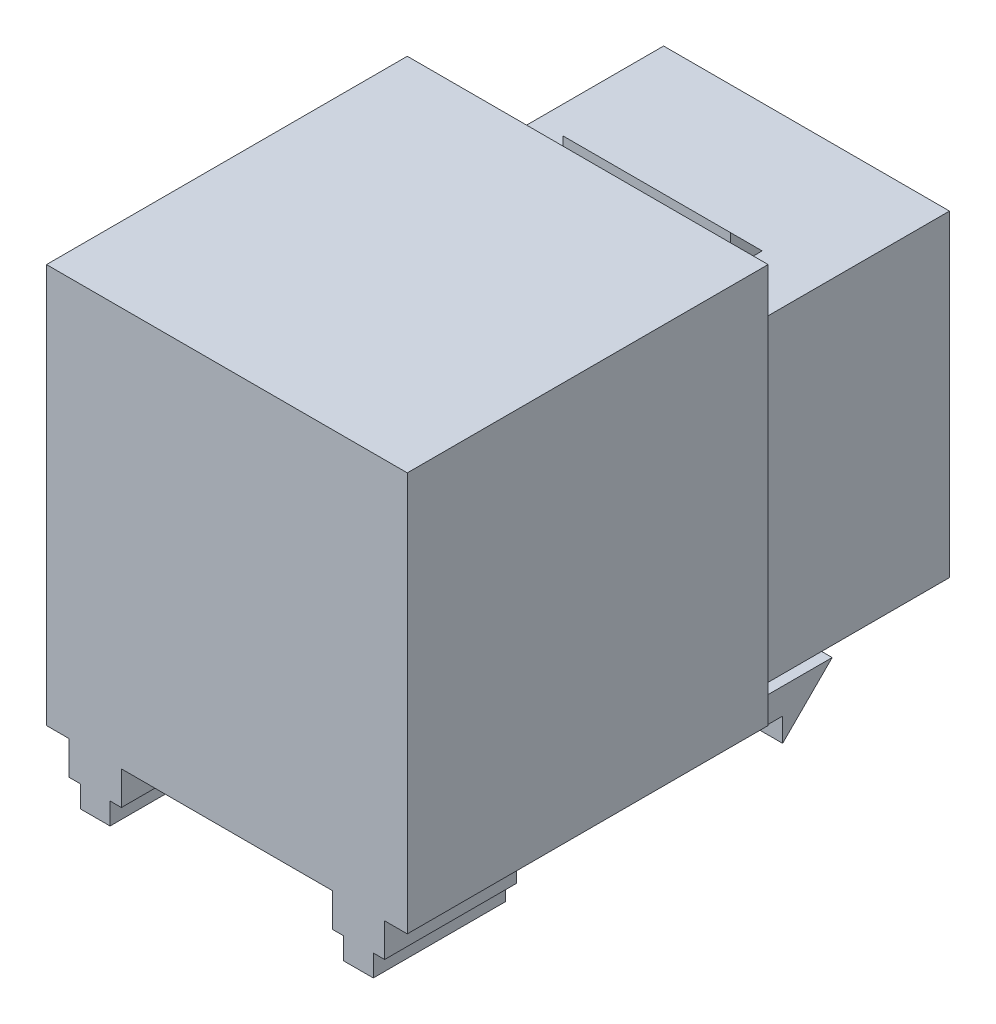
ISO-10303-21;
HEADER;
FILE_DESCRIPTION(('STEP AP214'),'2;1');
FILE_NAME('part.step','',(''),(''),'','','');
FILE_SCHEMA(('AUTOMOTIVE_DESIGN { 1 0 10303 214 1 1 1 1 }'));
ENDSEC;
DATA;
#1=APPLICATION_CONTEXT('core data for automotive mechanical design processes');
#2=APPLICATION_PROTOCOL_DEFINITION('international standard','automotive_design',2000,#1);
#3=PRODUCT_CONTEXT('',#1,'mechanical');
#4=PRODUCT('Part','Part','',(#3));
#5=PRODUCT_RELATED_PRODUCT_CATEGORY('part','',(#4));
#6=PRODUCT_DEFINITION_FORMATION('','',#4);
#7=PRODUCT_DEFINITION_CONTEXT('part definition',#1,'design');
#8=PRODUCT_DEFINITION('design','',#6,#7);
#9=PRODUCT_DEFINITION_SHAPE('','',#8);
#10=(LENGTH_UNIT() NAMED_UNIT(*) SI_UNIT(.MILLI.,.METRE.));
#11=(NAMED_UNIT(*) PLANE_ANGLE_UNIT() SI_UNIT($,.RADIAN.));
#12=(NAMED_UNIT(*) SI_UNIT($,.STERADIAN.) SOLID_ANGLE_UNIT());
#13=UNCERTAINTY_MEASURE_WITH_UNIT(LENGTH_MEASURE(1.E-05),#10,'distance_accuracy_value','');
#14=(GEOMETRIC_REPRESENTATION_CONTEXT(3) GLOBAL_UNCERTAINTY_ASSIGNED_CONTEXT((#13)) GLOBAL_UNIT_ASSIGNED_CONTEXT((#10,
#11,#12)) REPRESENTATION_CONTEXT('',''));
#15=CARTESIAN_POINT('',(0.,0.,0.));
#16=DIRECTION('',(0.,0.,1.));
#17=DIRECTION('',(1.,0.,0.));
#18=AXIS2_PLACEMENT_3D('',#15,#16,#17);
#19=CARTESIAN_POINT('',(-7.25,-8.05,11.1));
#20=DIRECTION('',(0.,1.,0.));
#21=DIRECTION('',(0.,0.,1.));
#22=AXIS2_PLACEMENT_3D('',#19,#20,#21);
#23=PLANE('',#22);
#24=DIRECTION('',(0.,0.,-1.));
#25=VECTOR('',#24,1.);
#26=CARTESIAN_POINT('',(-6.,-8.05,14.8));
#27=LINE('',#26,#25);
#28=CARTESIAN_POINT('',(-6.,-8.05,16.8));
#29=VERTEX_POINT('',#28);
#30=CARTESIAN_POINT('',(-6.,-8.05,14.8));
#31=VERTEX_POINT('',#30);
#32=EDGE_CURVE('E346',#29,#31,#27,.T.);
#33=ORIENTED_EDGE('',*,*,#32,.F.);
#34=DIRECTION('',(1.,0.,0.));
#35=VECTOR('',#34,1.);
#36=CARTESIAN_POINT('',(-6.,-8.05,16.8));
#37=LINE('',#36,#35);
#38=CARTESIAN_POINT('',(6.,-8.05,16.8));
#39=VERTEX_POINT('',#38);
#40=EDGE_CURVE('E362',#29,#39,#37,.T.);
#41=ORIENTED_EDGE('',*,*,#40,.T.);
#42=DIRECTION('',(0.,0.,-1.));
#43=VECTOR('',#42,1.);
#44=CARTESIAN_POINT('',(6.,-8.05,14.8));
#45=LINE('',#44,#43);
#46=CARTESIAN_POINT('',(6.,-8.05,14.8));
#47=VERTEX_POINT('',#46);
#48=EDGE_CURVE('E305',#39,#47,#45,.T.);
#49=ORIENTED_EDGE('',*,*,#48,.T.);
#50=DIRECTION('',(1.,0.,0.));
#51=VECTOR('',#50,1.);
#52=CARTESIAN_POINT('',(-6.,-8.05,14.8));
#53=LINE('',#52,#51);
#54=EDGE_CURVE('E393',#31,#47,#53,.T.);
#55=ORIENTED_EDGE('',*,*,#54,.F.);
#56=EDGE_LOOP('',(#33,#41,#49,#55));
#57=FACE_BOUND('',#56,.T.);
#58=DIRECTION('',(0.,0.,-1.));
#59=VECTOR('',#58,1.);
#60=CARTESIAN_POINT('',(5.35,-8.05,33.2551913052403));
#61=LINE('',#60,#59);
#62=CARTESIAN_POINT('',(5.35,-8.05,29.4));
#63=VERTEX_POINT('',#62);
#64=CARTESIAN_POINT('',(5.35,-8.05,22.7));
#65=VERTEX_POINT('',#64);
#66=EDGE_CURVE('E278',#63,#65,#61,.T.);
#67=ORIENTED_EDGE('',*,*,#66,.F.);
#68=DIRECTION('',(1.,0.,0.));
#69=VECTOR('',#68,1.);
#70=CARTESIAN_POINT('',(-9.15,-8.05,29.4));
#71=LINE('',#70,#69);
#72=CARTESIAN_POINT('',(-5.35,-8.05,29.4));
#73=VERTEX_POINT('',#72);
#74=EDGE_CURVE('E429',#73,#63,#71,.T.);
#75=ORIENTED_EDGE('',*,*,#74,.F.);
#76=DIRECTION('',(0.,0.,-1.));
#77=VECTOR('',#76,1.);
#78=CARTESIAN_POINT('',(-5.35,-8.05,33.2551913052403));
#79=LINE('',#78,#77);
#80=CARTESIAN_POINT('',(-5.35,-8.05,22.7));
#81=VERTEX_POINT('',#80);
#82=EDGE_CURVE('E57',#73,#81,#79,.T.);
#83=ORIENTED_EDGE('',*,*,#82,.T.);
#84=DIRECTION('',(-1.,0.,0.));
#85=VECTOR('',#84,1.);
#86=CARTESIAN_POINT('',(-8.,-8.05,22.7));
#87=LINE('',#86,#85);
#88=CARTESIAN_POINT('',(-8.,-8.05,22.7));
#89=VERTEX_POINT('',#88);
#90=EDGE_CURVE('E306',#81,#89,#87,.T.);
#91=ORIENTED_EDGE('',*,*,#90,.T.);
#92=DIRECTION('',(0.,0.,-1.));
#93=VECTOR('',#92,1.);
#94=CARTESIAN_POINT('',(-8.,-8.05,33.2551913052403));
#95=LINE('',#94,#93);
#96=CARTESIAN_POINT('',(-8.,-8.05,29.4));
#97=VERTEX_POINT('',#96);
#98=EDGE_CURVE('E343',#97,#89,#95,.T.);
#99=ORIENTED_EDGE('',*,*,#98,.F.);
#100=CARTESIAN_POINT('',(-9.15,-8.05,29.4));
#101=VERTEX_POINT('',#100);
#102=EDGE_CURVE('E425',#101,#97,#71,.T.);
#103=ORIENTED_EDGE('',*,*,#102,.F.);
#104=DIRECTION('',(0.,0.,-1.));
#105=VECTOR('',#104,1.);
#106=CARTESIAN_POINT('',(-9.15,-8.05,29.4));
#107=LINE('',#106,#105);
#108=CARTESIAN_POINT('',(-9.15,-8.05,11.1));
#109=VERTEX_POINT('',#108);
#110=EDGE_CURVE('E446',#101,#109,#107,.T.);
#111=ORIENTED_EDGE('',*,*,#110,.T.);
#112=DIRECTION('',(1.,0.,0.));
#113=VECTOR('',#112,1.);
#114=CARTESIAN_POINT('',(-9.15,-8.05,11.1));
#115=LINE('',#114,#113);
#116=CARTESIAN_POINT('',(-7.25,-8.05,11.1));
#117=VERTEX_POINT('',#116);
#118=EDGE_CURVE('E437',#109,#117,#115,.T.);
#119=ORIENTED_EDGE('',*,*,#118,.T.);
#120=DIRECTION('',(0.,0.,-1.));
#121=VECTOR('',#120,1.);
#122=CARTESIAN_POINT('',(-7.25,-8.05,11.1));
#123=LINE('',#122,#121);
#124=CARTESIAN_POINT('',(-7.25,-8.05,0.));
#125=VERTEX_POINT('',#124);
#126=EDGE_CURVE('E473',#117,#125,#123,.T.);
#127=ORIENTED_EDGE('',*,*,#126,.T.);
#128=DIRECTION('',(1.,0.,0.));
#129=VECTOR('',#128,1.);
#130=CARTESIAN_POINT('',(-7.25,-8.05,0.));
#131=LINE('',#130,#129);
#132=CARTESIAN_POINT('',(7.25,-8.05,0.));
#133=VERTEX_POINT('',#132);
#134=EDGE_CURVE('E457',#125,#133,#131,.T.);
#135=ORIENTED_EDGE('',*,*,#134,.T.);
#136=DIRECTION('',(0.,0.,-1.));
#137=VECTOR('',#136,1.);
#138=CARTESIAN_POINT('',(7.25,-8.05,11.1));
#139=LINE('',#138,#137);
#140=CARTESIAN_POINT('',(7.25,-8.05,11.1));
#141=VERTEX_POINT('',#140);
#142=EDGE_CURVE('E463',#141,#133,#139,.T.);
#143=ORIENTED_EDGE('',*,*,#142,.F.);
#144=CARTESIAN_POINT('',(9.15,-8.05,11.1));
#145=VERTEX_POINT('',#144);
#146=EDGE_CURVE('E436',#141,#145,#115,.T.);
#147=ORIENTED_EDGE('',*,*,#146,.T.);
#148=DIRECTION('',(0.,0.,-1.));
#149=VECTOR('',#148,1.);
#150=CARTESIAN_POINT('',(9.15,-8.05,29.4));
#151=LINE('',#150,#149);
#152=CARTESIAN_POINT('',(9.15,-8.05,29.4));
#153=VERTEX_POINT('',#152);
#154=EDGE_CURVE('E443',#153,#145,#151,.T.);
#155=ORIENTED_EDGE('',*,*,#154,.F.);
#156=CARTESIAN_POINT('',(7.99999999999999,-8.05,29.4));
#157=VERTEX_POINT('',#156);
#158=EDGE_CURVE('E276',#157,#153,#71,.T.);
#159=ORIENTED_EDGE('',*,*,#158,.F.);
#160=DIRECTION('',(0.,0.,-1.));
#161=VECTOR('',#160,1.);
#162=CARTESIAN_POINT('',(8.,-8.05,33.2551913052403));
#163=LINE('',#162,#161);
#164=CARTESIAN_POINT('',(8.,-8.05,22.7));
#165=VERTEX_POINT('',#164);
#166=EDGE_CURVE('E49',#157,#165,#163,.T.);
#167=ORIENTED_EDGE('',*,*,#166,.T.);
#168=DIRECTION('',(-1.,0.,0.));
#169=VECTOR('',#168,1.);
#170=CARTESIAN_POINT('',(8.,-8.05,22.7));
#171=LINE('',#170,#169);
#172=EDGE_CURVE('E259',#165,#65,#171,.T.);
#173=ORIENTED_EDGE('',*,*,#172,.T.);
#174=EDGE_LOOP('',(#67,#75,#83,#91,#99,#103,#111,#119,#127,#135,#143,#147,#155,#159,#167,#173));
#175=FACE_BOUND('',#174,.T.);
#176=ADVANCED_FACE('F34',(#57,#175),#23,.F.);
#177=CARTESIAN_POINT('',(7.25,-8.05,11.1));
#178=DIRECTION('',(-1.,0.,0.));
#179=DIRECTION('',(0.,0.,1.));
#180=AXIS2_PLACEMENT_3D('',#177,#178,#179);
#181=PLANE('',#180);
#182=DIRECTION('',(0.,1.,0.));
#183=VECTOR('',#182,1.);
#184=CARTESIAN_POINT('',(7.25,-8.05,0.));
#185=LINE('',#184,#183);
#186=CARTESIAN_POINT('',(7.25,8.05,0.));
#187=VERTEX_POINT('',#186);
#188=EDGE_CURVE('E452',#133,#187,#185,.T.);
#189=ORIENTED_EDGE('',*,*,#188,.T.);
#190=DIRECTION('',(0.,0.,-1.));
#191=VECTOR('',#190,1.);
#192=CARTESIAN_POINT('',(7.25,8.05,11.1));
#193=LINE('',#192,#191);
#194=CARTESIAN_POINT('',(7.25,8.05,11.1));
#195=VERTEX_POINT('',#194);
#196=EDGE_CURVE('E11',#195,#187,#193,.T.);
#197=ORIENTED_EDGE('',*,*,#196,.F.);
#198=DIRECTION('',(0.,1.,0.));
#199=VECTOR('',#198,1.);
#200=CARTESIAN_POINT('',(7.25,-8.05,11.1));
#201=LINE('',#200,#199);
#202=EDGE_CURVE('E453',#141,#195,#201,.T.);
#203=ORIENTED_EDGE('',*,*,#202,.F.);
#204=ORIENTED_EDGE('',*,*,#142,.T.);
#205=EDGE_LOOP('',(#189,#197,#203,#204));
#206=FACE_BOUND('',#205,.T.);
#207=ADVANCED_FACE('F36',(#206),#181,.F.);
#208=CARTESIAN_POINT('',(-7.25,8.05,11.1));
#209=DIRECTION('',(0.,-1.,0.));
#210=DIRECTION('',(0.,0.,-1.));
#211=AXIS2_PLACEMENT_3D('',#208,#209,#210);
#212=PLANE('',#211);
#213=DIRECTION('',(1.,0.,0.));
#214=VECTOR('',#213,1.);
#215=CARTESIAN_POINT('',(-4.25,8.05,8.1));
#216=LINE('',#215,#214);
#217=CARTESIAN_POINT('',(-4.25,8.05,8.1));
#218=VERTEX_POINT('',#217);
#219=CARTESIAN_POINT('',(4.25,8.05,8.1));
#220=VERTEX_POINT('',#219);
#221=EDGE_CURVE('E415',#218,#220,#216,.T.);
#222=ORIENTED_EDGE('',*,*,#221,.F.);
#223=DIRECTION('',(0.,0.,1.));
#224=VECTOR('',#223,1.);
#225=CARTESIAN_POINT('',(-4.25,8.05,6.5));
#226=LINE('',#225,#224);
#227=CARTESIAN_POINT('',(-4.25,8.05,6.5));
#228=VERTEX_POINT('',#227);
#229=EDGE_CURVE('E396',#228,#218,#226,.T.);
#230=ORIENTED_EDGE('',*,*,#229,.F.);
#231=DIRECTION('',(1.,0.,0.));
#232=VECTOR('',#231,1.);
#233=CARTESIAN_POINT('',(-4.25,8.05,6.5));
#234=LINE('',#233,#232);
#235=CARTESIAN_POINT('',(4.25,8.05,6.5));
#236=VERTEX_POINT('',#235);
#237=EDGE_CURVE('E405',#228,#236,#234,.T.);
#238=ORIENTED_EDGE('',*,*,#237,.T.);
#239=DIRECTION('',(0.,0.,1.));
#240=VECTOR('',#239,1.);
#241=CARTESIAN_POINT('',(4.25,8.05,6.5));
#242=LINE('',#241,#240);
#243=EDGE_CURVE('E395',#236,#220,#242,.T.);
#244=ORIENTED_EDGE('',*,*,#243,.T.);
#245=EDGE_LOOP('',(#222,#230,#238,#244));
#246=FACE_BOUND('',#245,.T.);
#247=DIRECTION('',(-1.,0.,0.));
#248=VECTOR('',#247,1.);
#249=CARTESIAN_POINT('',(-7.25,8.05,0.));
#250=LINE('',#249,#248);
#251=CARTESIAN_POINT('',(-7.25,8.05,0.));
#252=VERTEX_POINT('',#251);
#253=EDGE_CURVE('E466',#187,#252,#250,.T.);
#254=ORIENTED_EDGE('',*,*,#253,.T.);
#255=DIRECTION('',(0.,0.,-1.));
#256=VECTOR('',#255,1.);
#257=CARTESIAN_POINT('',(-7.25,8.05,11.1));
#258=LINE('',#257,#256);
#259=CARTESIAN_POINT('',(-7.25,8.05,11.1));
#260=VERTEX_POINT('',#259);
#261=EDGE_CURVE('E42',#260,#252,#258,.T.);
#262=ORIENTED_EDGE('',*,*,#261,.F.);
#263=DIRECTION('',(-1.,0.,0.));
#264=VECTOR('',#263,1.);
#265=CARTESIAN_POINT('',(-7.25,8.05,11.1));
#266=LINE('',#265,#264);
#267=EDGE_CURVE('E456',#195,#260,#266,.T.);
#268=ORIENTED_EDGE('',*,*,#267,.F.);
#269=ORIENTED_EDGE('',*,*,#196,.T.);
#270=EDGE_LOOP('',(#254,#262,#268,#269));
#271=FACE_BOUND('',#270,.T.);
#272=ADVANCED_FACE('F576',(#246,#271),#212,.F.);
#273=CARTESIAN_POINT('',(-7.25,-8.05,11.1));
#274=DIRECTION('',(1.,0.,0.));
#275=DIRECTION('',(0.,0.,-1.));
#276=AXIS2_PLACEMENT_3D('',#273,#274,#275);
#277=PLANE('',#276);
#278=DIRECTION('',(0.,-1.,0.));
#279=VECTOR('',#278,1.);
#280=CARTESIAN_POINT('',(-7.25,-8.05,0.));
#281=LINE('',#280,#279);
#282=EDGE_CURVE('E468',#252,#125,#281,.T.);
#283=ORIENTED_EDGE('',*,*,#282,.T.);
#284=ORIENTED_EDGE('',*,*,#126,.F.);
#285=DIRECTION('',(0.,-1.,0.));
#286=VECTOR('',#285,1.);
#287=CARTESIAN_POINT('',(-7.25,-8.05,11.1));
#288=LINE('',#287,#286);
#289=EDGE_CURVE('E460',#260,#117,#288,.T.);
#290=ORIENTED_EDGE('',*,*,#289,.F.);
#291=ORIENTED_EDGE('',*,*,#261,.T.);
#292=EDGE_LOOP('',(#283,#284,#290,#291));
#293=FACE_BOUND('',#292,.T.);
#294=ADVANCED_FACE('F479',(#293),#277,.F.);
#295=CARTESIAN_POINT('',(0.,0.,0.));
#296=DIRECTION('',(0.,0.,-1.));
#297=DIRECTION('',(-1.,0.,0.));
#298=AXIS2_PLACEMENT_3D('',#295,#296,#297);
#299=PLANE('',#298);
#300=ORIENTED_EDGE('',*,*,#188,.F.);
#301=ORIENTED_EDGE('',*,*,#134,.F.);
#302=ORIENTED_EDGE('',*,*,#282,.F.);
#303=ORIENTED_EDGE('',*,*,#253,.F.);
#304=EDGE_LOOP('',(#300,#301,#302,#303));
#305=FACE_BOUND('',#304,.T.);
#306=ADVANCED_FACE('F484',(#305),#299,.T.);
#307=CARTESIAN_POINT('',(9.15,12.2,29.4));
#308=DIRECTION('',(0.,-1.,0.));
#309=DIRECTION('',(0.,0.,-1.));
#310=AXIS2_PLACEMENT_3D('',#307,#308,#309);
#311=PLANE('',#310);
#312=DIRECTION('',(-1.,0.,0.));
#313=VECTOR('',#312,1.);
#314=CARTESIAN_POINT('',(9.15,12.2,11.1));
#315=LINE('',#314,#313);
#316=CARTESIAN_POINT('',(9.15,12.2,11.1));
#317=VERTEX_POINT('',#316);
#318=CARTESIAN_POINT('',(-9.15,12.2,11.1));
#319=VERTEX_POINT('',#318);
#320=EDGE_CURVE('E418',#317,#319,#315,.T.);
#321=ORIENTED_EDGE('',*,*,#320,.T.);
#322=DIRECTION('',(0.,0.,-1.));
#323=VECTOR('',#322,1.);
#324=CARTESIAN_POINT('',(-9.15,12.2,29.4));
#325=LINE('',#324,#323);
#326=CARTESIAN_POINT('',(-9.15,12.2,29.4));
#327=VERTEX_POINT('',#326);
#328=EDGE_CURVE('E449',#327,#319,#325,.T.);
#329=ORIENTED_EDGE('',*,*,#328,.F.);
#330=DIRECTION('',(-1.,0.,0.));
#331=VECTOR('',#330,1.);
#332=CARTESIAN_POINT('',(9.15,12.2,29.4));
#333=LINE('',#332,#331);
#334=CARTESIAN_POINT('',(9.15,12.2,29.4));
#335=VERTEX_POINT('',#334);
#336=EDGE_CURVE('E419',#335,#327,#333,.T.);
#337=ORIENTED_EDGE('',*,*,#336,.F.);
#338=DIRECTION('',(0.,0.,-1.));
#339=VECTOR('',#338,1.);
#340=CARTESIAN_POINT('',(9.15,12.2,29.4));
#341=LINE('',#340,#339);
#342=EDGE_CURVE('E431',#335,#317,#341,.T.);
#343=ORIENTED_EDGE('',*,*,#342,.T.);
#344=EDGE_LOOP('',(#321,#329,#337,#343));
#345=FACE_BOUND('',#344,.T.);
#346=ADVANCED_FACE('F594',(#345),#311,.F.);
#347=CARTESIAN_POINT('',(-9.15,-8.05,29.4));
#348=DIRECTION('',(1.,0.,0.));
#349=DIRECTION('',(0.,1.,0.));
#350=AXIS2_PLACEMENT_3D('',#347,#348,#349);
#351=PLANE('',#350);
#352=DIRECTION('',(0.,-1.,0.));
#353=VECTOR('',#352,1.);
#354=CARTESIAN_POINT('',(-9.15,-8.05,11.1));
#355=LINE('',#354,#353);
#356=EDGE_CURVE('E434',#319,#109,#355,.T.);
#357=ORIENTED_EDGE('',*,*,#356,.T.);
#358=ORIENTED_EDGE('',*,*,#110,.F.);
#359=DIRECTION('',(0.,-1.,0.));
#360=VECTOR('',#359,1.);
#361=CARTESIAN_POINT('',(-9.15,-8.05,29.4));
#362=LINE('',#361,#360);
#363=EDGE_CURVE('E422',#327,#101,#362,.T.);
#364=ORIENTED_EDGE('',*,*,#363,.F.);
#365=ORIENTED_EDGE('',*,*,#328,.T.);
#366=EDGE_LOOP('',(#357,#358,#364,#365));
#367=FACE_BOUND('',#366,.T.);
#368=ADVANCED_FACE('F592',(#367),#351,.F.);
#369=CARTESIAN_POINT('',(9.15,-8.05,29.4));
#370=DIRECTION('',(-1.,0.,0.));
#371=DIRECTION('',(0.,0.,1.));
#372=AXIS2_PLACEMENT_3D('',#369,#370,#371);
#373=PLANE('',#372);
#374=DIRECTION('',(0.,1.,0.));
#375=VECTOR('',#374,1.);
#376=CARTESIAN_POINT('',(9.15,-8.05,11.1));
#377=LINE('',#376,#375);
#378=EDGE_CURVE('E423',#145,#317,#377,.T.);
#379=ORIENTED_EDGE('',*,*,#378,.T.);
#380=ORIENTED_EDGE('',*,*,#342,.F.);
#381=DIRECTION('',(0.,1.,0.));
#382=VECTOR('',#381,1.);
#383=CARTESIAN_POINT('',(9.15,-8.05,29.4));
#384=LINE('',#383,#382);
#385=EDGE_CURVE('E428',#153,#335,#384,.T.);
#386=ORIENTED_EDGE('',*,*,#385,.F.);
#387=ORIENTED_EDGE('',*,*,#154,.T.);
#388=EDGE_LOOP('',(#379,#380,#386,#387));
#389=FACE_BOUND('',#388,.T.);
#390=ADVANCED_FACE('F495',(#389),#373,.F.);
#391=CARTESIAN_POINT('',(0.,0.,29.4));
#392=DIRECTION('',(0.,0.,-1.));
#393=DIRECTION('',(-1.,0.,0.));
#394=AXIS2_PLACEMENT_3D('',#391,#392,#393);
#395=PLANE('',#394);
#396=ORIENTED_EDGE('',*,*,#336,.T.);
#397=ORIENTED_EDGE('',*,*,#363,.T.);
#398=ORIENTED_EDGE('',*,*,#102,.T.);
#399=DIRECTION('',(0.,1.,0.));
#400=VECTOR('',#399,1.);
#401=CARTESIAN_POINT('',(-8.,-8.05,29.4));
#402=LINE('',#401,#400);
#403=CARTESIAN_POINT('',(-8.,-9.75,29.4));
#404=VERTEX_POINT('',#403);
#405=EDGE_CURVE('E303',#404,#97,#402,.T.);
#406=ORIENTED_EDGE('',*,*,#405,.F.);
#407=DIRECTION('',(-1.,0.,0.));
#408=VECTOR('',#407,1.);
#409=CARTESIAN_POINT('',(-8.,-9.75,29.4));
#410=LINE('',#409,#408);
#411=CARTESIAN_POINT('',(-7.425,-9.75,29.4));
#412=VERTEX_POINT('',#411);
#413=EDGE_CURVE('E300',#412,#404,#410,.T.);
#414=ORIENTED_EDGE('',*,*,#413,.F.);
#415=DIRECTION('',(0.,1.,0.));
#416=VECTOR('',#415,1.);
#417=CARTESIAN_POINT('',(-7.425,-9.75,29.4));
#418=LINE('',#417,#416);
#419=CARTESIAN_POINT('',(-7.425,-10.85,29.4));
#420=VERTEX_POINT('',#419);
#421=EDGE_CURVE('E297',#420,#412,#418,.T.);
#422=ORIENTED_EDGE('',*,*,#421,.F.);
#423=DIRECTION('',(-1.,0.,0.));
#424=VECTOR('',#423,1.);
#425=CARTESIAN_POINT('',(-5.925,-10.85,29.4));
#426=LINE('',#425,#424);
#427=CARTESIAN_POINT('',(-5.925,-10.85,29.4));
#428=VERTEX_POINT('',#427);
#429=EDGE_CURVE('E294',#428,#420,#426,.T.);
#430=ORIENTED_EDGE('',*,*,#429,.F.);
#431=DIRECTION('',(0.,-1.,0.));
#432=VECTOR('',#431,1.);
#433=CARTESIAN_POINT('',(-5.925,-9.75,29.4));
#434=LINE('',#433,#432);
#435=CARTESIAN_POINT('',(-5.925,-9.75,29.4));
#436=VERTEX_POINT('',#435);
#437=EDGE_CURVE('E290',#436,#428,#434,.T.);
#438=ORIENTED_EDGE('',*,*,#437,.F.);
#439=DIRECTION('',(-1.,0.,0.));
#440=VECTOR('',#439,1.);
#441=CARTESIAN_POINT('',(-5.925,-9.75,29.4));
#442=LINE('',#441,#440);
#443=CARTESIAN_POINT('',(-5.35,-9.75,29.4));
#444=VERTEX_POINT('',#443);
#445=EDGE_CURVE('E287',#444,#436,#442,.T.);
#446=ORIENTED_EDGE('',*,*,#445,.F.);
#447=DIRECTION('',(0.,-1.,0.));
#448=VECTOR('',#447,1.);
#449=CARTESIAN_POINT('',(-5.35,-9.75,29.4));
#450=LINE('',#449,#448);
#451=EDGE_CURVE('E291',#73,#444,#450,.T.);
#452=ORIENTED_EDGE('',*,*,#451,.F.);
#453=ORIENTED_EDGE('',*,*,#74,.T.);
#454=DIRECTION('',(0.,1.,0.));
#455=VECTOR('',#454,1.);
#456=CARTESIAN_POINT('',(5.35,-9.75,29.4));
#457=LINE('',#456,#455);
#458=CARTESIAN_POINT('',(5.35,-9.75,29.4));
#459=VERTEX_POINT('',#458);
#460=EDGE_CURVE('E503',#459,#63,#457,.T.);
#461=ORIENTED_EDGE('',*,*,#460,.F.);
#462=DIRECTION('',(-1.,0.,0.));
#463=VECTOR('',#462,1.);
#464=CARTESIAN_POINT('',(5.925,-9.75,29.4));
#465=LINE('',#464,#463);
#466=CARTESIAN_POINT('',(5.925,-9.75,29.4));
#467=VERTEX_POINT('',#466);
#468=EDGE_CURVE('E508',#467,#459,#465,.T.);
#469=ORIENTED_EDGE('',*,*,#468,.F.);
#470=DIRECTION('',(0.,1.,0.));
#471=VECTOR('',#470,1.);
#472=CARTESIAN_POINT('',(5.925,-9.75,29.4));
#473=LINE('',#472,#471);
#474=CARTESIAN_POINT('',(5.925,-10.85,29.4));
#475=VERTEX_POINT('',#474);
#476=EDGE_CURVE('E511',#475,#467,#473,.T.);
#477=ORIENTED_EDGE('',*,*,#476,.F.);
#478=DIRECTION('',(-1.,0.,0.));
#479=VECTOR('',#478,1.);
#480=CARTESIAN_POINT('',(5.925,-10.85,29.4));
#481=LINE('',#480,#479);
#482=CARTESIAN_POINT('',(7.425,-10.85,29.4));
#483=VERTEX_POINT('',#482);
#484=EDGE_CURVE('E545',#483,#475,#481,.T.);
#485=ORIENTED_EDGE('',*,*,#484,.F.);
#486=DIRECTION('',(0.,-1.,0.));
#487=VECTOR('',#486,1.);
#488=CARTESIAN_POINT('',(7.425,-9.74999999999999,29.4));
#489=LINE('',#488,#487);
#490=CARTESIAN_POINT('',(7.425,-9.74999999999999,29.4));
#491=VERTEX_POINT('',#490);
#492=EDGE_CURVE('E281',#491,#483,#489,.T.);
#493=ORIENTED_EDGE('',*,*,#492,.F.);
#494=DIRECTION('',(-1.,0.,0.));
#495=VECTOR('',#494,1.);
#496=CARTESIAN_POINT('',(8.,-9.74999999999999,29.4));
#497=LINE('',#496,#495);
#498=CARTESIAN_POINT('',(8.,-9.74999999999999,29.4));
#499=VERTEX_POINT('',#498);
#500=EDGE_CURVE('E277',#499,#491,#497,.T.);
#501=ORIENTED_EDGE('',*,*,#500,.F.);
#502=DIRECTION('',(0.,-1.,0.));
#503=VECTOR('',#502,1.);
#504=CARTESIAN_POINT('',(8.,-8.05,29.4));
#505=LINE('',#504,#503);
#506=EDGE_CURVE('E310',#157,#499,#505,.T.);
#507=ORIENTED_EDGE('',*,*,#506,.F.);
#508=ORIENTED_EDGE('',*,*,#158,.T.);
#509=ORIENTED_EDGE('',*,*,#385,.T.);
#510=EDGE_LOOP('',(#396,#397,#398,#406,#414,#422,#430,#438,#446,#452,#453,#461,#469,#477,#485,
#493,#501,#507,#508,#509));
#511=FACE_BOUND('',#510,.T.);
#512=ADVANCED_FACE('F499',(#511),#395,.F.);
#513=CARTESIAN_POINT('',(0.,0.,11.1));
#514=DIRECTION('',(0.,0.,-1.));
#515=DIRECTION('',(-1.,0.,0.));
#516=AXIS2_PLACEMENT_3D('',#513,#514,#515);
#517=PLANE('',#516);
#518=ORIENTED_EDGE('',*,*,#146,.F.);
#519=ORIENTED_EDGE('',*,*,#202,.T.);
#520=ORIENTED_EDGE('',*,*,#267,.T.);
#521=ORIENTED_EDGE('',*,*,#289,.T.);
#522=ORIENTED_EDGE('',*,*,#118,.F.);
#523=ORIENTED_EDGE('',*,*,#356,.F.);
#524=ORIENTED_EDGE('',*,*,#320,.F.);
#525=ORIENTED_EDGE('',*,*,#378,.F.);
#526=EDGE_LOOP('',(#518,#519,#520,#521,#522,#523,#524,#525));
#527=FACE_BOUND('',#526,.T.);
#528=ADVANCED_FACE('F491',(#527),#517,.T.);
#529=CARTESIAN_POINT('',(-4.25,8.05,8.1));
#530=DIRECTION('',(0.,0.,-1.));
#531=DIRECTION('',(-1.,0.,0.));
#532=AXIS2_PLACEMENT_3D('',#529,#530,#531);
#533=PLANE('',#532);
#534=DIRECTION('',(0.,1.,0.));
#535=VECTOR('',#534,1.);
#536=CARTESIAN_POINT('',(4.25,8.05,8.1));
#537=LINE('',#536,#535);
#538=CARTESIAN_POINT('',(4.25,9.64999999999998,8.1));
#539=VERTEX_POINT('',#538);
#540=EDGE_CURVE('E407',#220,#539,#537,.T.);
#541=ORIENTED_EDGE('',*,*,#540,.T.);
#542=DIRECTION('',(1.,0.,0.));
#543=VECTOR('',#542,1.);
#544=CARTESIAN_POINT('',(-4.25,9.64999999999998,8.1));
#545=LINE('',#544,#543);
#546=CARTESIAN_POINT('',(-4.25,9.64999999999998,8.1));
#547=VERTEX_POINT('',#546);
#548=EDGE_CURVE('E412',#547,#539,#545,.T.);
#549=ORIENTED_EDGE('',*,*,#548,.F.);
#550=DIRECTION('',(0.,1.,0.));
#551=VECTOR('',#550,1.);
#552=CARTESIAN_POINT('',(-4.25,8.05,8.1));
#553=LINE('',#552,#551);
#554=EDGE_CURVE('E399',#218,#547,#553,.T.);
#555=ORIENTED_EDGE('',*,*,#554,.F.);
#556=ORIENTED_EDGE('',*,*,#221,.T.);
#557=EDGE_LOOP('',(#541,#549,#555,#556));
#558=FACE_BOUND('',#557,.T.);
#559=ADVANCED_FACE('F606',(#558),#533,.F.);
#560=CARTESIAN_POINT('',(-4.25,9.64999999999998,8.1));
#561=DIRECTION('',(0.,-0.707106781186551,0.707106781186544));
#562=DIRECTION('',(0.,-0.707106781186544,-0.707106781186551));
#563=AXIS2_PLACEMENT_3D('',#560,#561,#562);
#564=PLANE('',#563);
#565=DIRECTION('',(0.,-0.707106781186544,-0.707106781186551));
#566=VECTOR('',#565,1.);
#567=CARTESIAN_POINT('',(4.25,9.64999999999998,8.1));
#568=LINE('',#567,#566);
#569=EDGE_CURVE('E400',#539,#236,#568,.T.);
#570=ORIENTED_EDGE('',*,*,#569,.T.);
#571=ORIENTED_EDGE('',*,*,#237,.F.);
#572=DIRECTION('',(0.,-0.707106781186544,-0.707106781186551));
#573=VECTOR('',#572,1.);
#574=CARTESIAN_POINT('',(-4.25,9.64999999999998,8.1));
#575=LINE('',#574,#573);
#576=EDGE_CURVE('E402',#547,#228,#575,.T.);
#577=ORIENTED_EDGE('',*,*,#576,.F.);
#578=ORIENTED_EDGE('',*,*,#548,.T.);
#579=EDGE_LOOP('',(#570,#571,#577,#578));
#580=FACE_BOUND('',#579,.T.);
#581=ADVANCED_FACE('F611',(#580),#564,.F.);
#582=CARTESIAN_POINT('',(-4.25,0.,0.));
#583=DIRECTION('',(-1.,0.,0.));
#584=DIRECTION('',(0.,0.,1.));
#585=AXIS2_PLACEMENT_3D('',#582,#583,#584);
#586=PLANE('',#585);
#587=ORIENTED_EDGE('',*,*,#229,.T.);
#588=ORIENTED_EDGE('',*,*,#554,.T.);
#589=ORIENTED_EDGE('',*,*,#576,.T.);
#590=EDGE_LOOP('',(#587,#588,#589));
#591=FACE_BOUND('',#590,.T.);
#592=ADVANCED_FACE('F615',(#591),#586,.T.);
#593=CARTESIAN_POINT('',(4.25,0.,0.));
#594=DIRECTION('',(-1.,0.,0.));
#595=DIRECTION('',(0.,0.,1.));
#596=AXIS2_PLACEMENT_3D('',#593,#594,#595);
#597=PLANE('',#596);
#598=ORIENTED_EDGE('',*,*,#243,.F.);
#599=ORIENTED_EDGE('',*,*,#569,.F.);
#600=ORIENTED_EDGE('',*,*,#540,.F.);
#601=EDGE_LOOP('',(#598,#599,#600));
#602=FACE_BOUND('',#601,.T.);
#603=ADVANCED_FACE('F617',(#602),#597,.F.);
#604=CARTESIAN_POINT('',(-6.,-8.05,14.8));
#605=DIRECTION('',(0.,0.,1.));
#606=DIRECTION('',(1.,0.,0.));
#607=AXIS2_PLACEMENT_3D('',#604,#605,#606);
#608=PLANE('',#607);
#609=DIRECTION('',(0.,-1.,0.));
#610=VECTOR('',#609,1.);
#611=CARTESIAN_POINT('',(6.,-8.05,14.8));
#612=LINE('',#611,#610);
#613=CARTESIAN_POINT('',(6.,-9.83643760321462,14.8));
#614=VERTEX_POINT('',#613);
#615=EDGE_CURVE('E365',#47,#614,#612,.T.);
#616=ORIENTED_EDGE('',*,*,#615,.T.);
#617=DIRECTION('',(1.,0.,0.));
#618=VECTOR('',#617,1.);
#619=CARTESIAN_POINT('',(-6.,-9.83643760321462,14.8));
#620=LINE('',#619,#618);
#621=CARTESIAN_POINT('',(-6.,-9.83643760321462,14.8));
#622=VERTEX_POINT('',#621);
#623=EDGE_CURVE('E390',#622,#614,#620,.T.);
#624=ORIENTED_EDGE('',*,*,#623,.F.);
#625=DIRECTION('',(0.,-1.,0.));
#626=VECTOR('',#625,1.);
#627=CARTESIAN_POINT('',(-6.,-8.05,14.8));
#628=LINE('',#627,#626);
#629=EDGE_CURVE('E349',#31,#622,#628,.T.);
#630=ORIENTED_EDGE('',*,*,#629,.F.);
#631=ORIENTED_EDGE('',*,*,#54,.T.);
#632=EDGE_LOOP('',(#616,#624,#630,#631));
#633=FACE_BOUND('',#632,.T.);
#634=ADVANCED_FACE('F620',(#633),#608,.F.);
#635=CARTESIAN_POINT('',(-6.,-9.83643760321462,14.8));
#636=DIRECTION('',(0.,-1.,0.));
#637=DIRECTION('',(0.,0.,-1.));
#638=AXIS2_PLACEMENT_3D('',#635,#636,#637);
#639=PLANE('',#638);
#640=DIRECTION('',(0.,0.,-1.));
#641=VECTOR('',#640,1.);
#642=CARTESIAN_POINT('',(6.,-9.83643760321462,14.8));
#643=LINE('',#642,#641);
#644=CARTESIAN_POINT('',(6.,-9.83643760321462,4.7));
#645=VERTEX_POINT('',#644);
#646=EDGE_CURVE('E367',#614,#645,#643,.T.);
#647=ORIENTED_EDGE('',*,*,#646,.T.);
#648=DIRECTION('',(1.,0.,0.));
#649=VECTOR('',#648,1.);
#650=CARTESIAN_POINT('',(-6.,-9.83643760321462,4.7));
#651=LINE('',#650,#649);
#652=CARTESIAN_POINT('',(-6.,-9.83643760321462,4.7));
#653=VERTEX_POINT('',#652);
#654=EDGE_CURVE('E387',#653,#645,#651,.T.);
#655=ORIENTED_EDGE('',*,*,#654,.F.);
#656=DIRECTION('',(0.,0.,-1.));
#657=VECTOR('',#656,1.);
#658=CARTESIAN_POINT('',(-6.,-9.83643760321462,14.8));
#659=LINE('',#658,#657);
#660=EDGE_CURVE('E352',#622,#653,#659,.T.);
#661=ORIENTED_EDGE('',*,*,#660,.F.);
#662=ORIENTED_EDGE('',*,*,#623,.T.);
#663=EDGE_LOOP('',(#647,#655,#661,#662));
#664=FACE_BOUND('',#663,.T.);
#665=ADVANCED_FACE('F627',(#664),#639,.F.);
#666=CARTESIAN_POINT('',(-6.,-9.83643760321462,4.7));
#667=DIRECTION('',(0.,0.707106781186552,0.707106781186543));
#668=DIRECTION('',(0.,-0.707106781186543,0.707106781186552));
#669=AXIS2_PLACEMENT_3D('',#666,#667,#668);
#670=PLANE('',#669);
#671=DIRECTION('',(0.,-0.707106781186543,0.707106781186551));
#672=VECTOR('',#671,1.);
#673=CARTESIAN_POINT('',(6.,-9.83643760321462,4.7));
#674=LINE('',#673,#672);
#675=CARTESIAN_POINT('',(6.,-12.35,7.21356239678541));
#676=VERTEX_POINT('',#675);
#677=EDGE_CURVE('E369',#645,#676,#674,.T.);
#678=ORIENTED_EDGE('',*,*,#677,.T.);
#679=DIRECTION('',(1.,0.,0.));
#680=VECTOR('',#679,1.);
#681=CARTESIAN_POINT('',(-6.,-12.35,7.21356239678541));
#682=LINE('',#681,#680);
#683=CARTESIAN_POINT('',(-6.,-12.35,7.21356239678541));
#684=VERTEX_POINT('',#683);
#685=EDGE_CURVE('E384',#684,#676,#682,.T.);
#686=ORIENTED_EDGE('',*,*,#685,.F.);
#687=DIRECTION('',(0.,-0.707106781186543,0.707106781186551));
#688=VECTOR('',#687,1.);
#689=CARTESIAN_POINT('',(-6.,-9.83643760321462,4.7));
#690=LINE('',#689,#688);
#691=EDGE_CURVE('E354',#653,#684,#690,.T.);
#692=ORIENTED_EDGE('',*,*,#691,.F.);
#693=ORIENTED_EDGE('',*,*,#654,.T.);
#694=EDGE_LOOP('',(#678,#686,#692,#693));
#695=FACE_BOUND('',#694,.T.);
#696=ADVANCED_FACE('F631',(#695),#670,.F.);
#697=CARTESIAN_POINT('',(-6.,-12.35,7.21356239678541));
#698=DIRECTION('',(0.,0.,-1.));
#699=DIRECTION('',(0.,1.,0.));
#700=AXIS2_PLACEMENT_3D('',#697,#698,#699);
#701=PLANE('',#700);
#702=DIRECTION('',(0.,1.,0.));
#703=VECTOR('',#702,1.);
#704=CARTESIAN_POINT('',(6.,-12.35,7.21356239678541));
#705=LINE('',#704,#703);
#706=CARTESIAN_POINT('',(6.,-11.15,7.21356239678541));
#707=VERTEX_POINT('',#706);
#708=EDGE_CURVE('E371',#676,#707,#705,.T.);
#709=ORIENTED_EDGE('',*,*,#708,.T.);
#710=DIRECTION('',(1.,0.,0.));
#711=VECTOR('',#710,1.);
#712=CARTESIAN_POINT('',(-6.,-11.15,7.21356239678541));
#713=LINE('',#712,#711);
#714=CARTESIAN_POINT('',(-6.,-11.15,7.21356239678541));
#715=VERTEX_POINT('',#714);
#716=EDGE_CURVE('E381',#715,#707,#713,.T.);
#717=ORIENTED_EDGE('',*,*,#716,.F.);
#718=DIRECTION('',(0.,1.,0.));
#719=VECTOR('',#718,1.);
#720=CARTESIAN_POINT('',(-6.,-12.35,7.21356239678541));
#721=LINE('',#720,#719);
#722=EDGE_CURVE('E356',#684,#715,#721,.T.);
#723=ORIENTED_EDGE('',*,*,#722,.F.);
#724=ORIENTED_EDGE('',*,*,#685,.T.);
#725=EDGE_LOOP('',(#709,#717,#723,#724));
#726=FACE_BOUND('',#725,.T.);
#727=ADVANCED_FACE('F635',(#726),#701,.F.);
#728=CARTESIAN_POINT('',(-6.,-11.15,7.21356239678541));
#729=DIRECTION('',(0.,1.,0.));
#730=DIRECTION('',(0.,0.,1.));
#731=AXIS2_PLACEMENT_3D('',#728,#729,#730);
#732=PLANE('',#731);
#733=DIRECTION('',(0.,0.,1.));
#734=VECTOR('',#733,1.);
#735=CARTESIAN_POINT('',(6.,-11.15,7.21356239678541));
#736=LINE('',#735,#734);
#737=CARTESIAN_POINT('',(6.,-11.15,16.8));
#738=VERTEX_POINT('',#737);
#739=EDGE_CURVE('E373',#707,#738,#736,.T.);
#740=ORIENTED_EDGE('',*,*,#739,.T.);
#741=DIRECTION('',(1.,0.,0.));
#742=VECTOR('',#741,1.);
#743=CARTESIAN_POINT('',(-6.,-11.15,16.8));
#744=LINE('',#743,#742);
#745=CARTESIAN_POINT('',(-6.,-11.15,16.8));
#746=VERTEX_POINT('',#745);
#747=EDGE_CURVE('E378',#746,#738,#744,.T.);
#748=ORIENTED_EDGE('',*,*,#747,.F.);
#749=DIRECTION('',(0.,0.,1.));
#750=VECTOR('',#749,1.);
#751=CARTESIAN_POINT('',(-6.,-11.15,7.21356239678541));
#752=LINE('',#751,#750);
#753=EDGE_CURVE('E358',#715,#746,#752,.T.);
#754=ORIENTED_EDGE('',*,*,#753,.F.);
#755=ORIENTED_EDGE('',*,*,#716,.T.);
#756=EDGE_LOOP('',(#740,#748,#754,#755));
#757=FACE_BOUND('',#756,.T.);
#758=ADVANCED_FACE('F639',(#757),#732,.F.);
#759=CARTESIAN_POINT('',(-6.,-8.05,16.8));
#760=DIRECTION('',(0.,0.,-1.));
#761=DIRECTION('',(-1.,0.,0.));
#762=AXIS2_PLACEMENT_3D('',#759,#760,#761);
#763=PLANE('',#762);
#764=DIRECTION('',(0.,1.,0.));
#765=VECTOR('',#764,1.);
#766=CARTESIAN_POINT('',(6.,-8.05,16.8));
#767=LINE('',#766,#765);
#768=EDGE_CURVE('E350',#738,#39,#767,.T.);
#769=ORIENTED_EDGE('',*,*,#768,.T.);
#770=ORIENTED_EDGE('',*,*,#40,.F.);
#771=DIRECTION('',(0.,1.,0.));
#772=VECTOR('',#771,1.);
#773=CARTESIAN_POINT('',(-6.,-8.05,16.8));
#774=LINE('',#773,#772);
#775=EDGE_CURVE('E360',#746,#29,#774,.T.);
#776=ORIENTED_EDGE('',*,*,#775,.F.);
#777=ORIENTED_EDGE('',*,*,#747,.T.);
#778=EDGE_LOOP('',(#769,#770,#776,#777));
#779=FACE_BOUND('',#778,.T.);
#780=ADVANCED_FACE('F643',(#779),#763,.F.);
#781=CARTESIAN_POINT('',(-6.,0.,0.));
#782=DIRECTION('',(1.,0.,0.));
#783=DIRECTION('',(0.,0.,-1.));
#784=AXIS2_PLACEMENT_3D('',#781,#782,#783);
#785=PLANE('',#784);
#786=ORIENTED_EDGE('',*,*,#32,.T.);
#787=ORIENTED_EDGE('',*,*,#629,.T.);
#788=ORIENTED_EDGE('',*,*,#660,.T.);
#789=ORIENTED_EDGE('',*,*,#691,.T.);
#790=ORIENTED_EDGE('',*,*,#722,.T.);
#791=ORIENTED_EDGE('',*,*,#753,.T.);
#792=ORIENTED_EDGE('',*,*,#775,.T.);
#793=EDGE_LOOP('',(#786,#787,#788,#789,#790,#791,#792));
#794=FACE_BOUND('',#793,.T.);
#795=ADVANCED_FACE('F647',(#794),#785,.F.);
#796=CARTESIAN_POINT('',(6.,0.,0.));
#797=DIRECTION('',(1.,0.,0.));
#798=DIRECTION('',(0.,0.,-1.));
#799=AXIS2_PLACEMENT_3D('',#796,#797,#798);
#800=PLANE('',#799);
#801=ORIENTED_EDGE('',*,*,#48,.F.);
#802=ORIENTED_EDGE('',*,*,#768,.F.);
#803=ORIENTED_EDGE('',*,*,#739,.F.);
#804=ORIENTED_EDGE('',*,*,#708,.F.);
#805=ORIENTED_EDGE('',*,*,#677,.F.);
#806=ORIENTED_EDGE('',*,*,#646,.F.);
#807=ORIENTED_EDGE('',*,*,#615,.F.);
#808=EDGE_LOOP('',(#801,#802,#803,#804,#805,#806,#807));
#809=FACE_BOUND('',#808,.T.);
#810=ADVANCED_FACE('F649',(#809),#800,.T.);
#811=CARTESIAN_POINT('',(0.,0.,22.7));
#812=DIRECTION('',(0.,0.,1.));
#813=DIRECTION('',(1.,0.,0.));
#814=AXIS2_PLACEMENT_3D('',#811,#812,#813);
#815=PLANE('',#814);
#816=ORIENTED_EDGE('',*,*,#90,.F.);
#817=DIRECTION('',(0.,1.,0.));
#818=VECTOR('',#817,1.);
#819=CARTESIAN_POINT('',(-5.35,-9.75,22.7));
#820=LINE('',#819,#818);
#821=CARTESIAN_POINT('',(-5.35,-9.75,22.7));
#822=VERTEX_POINT('',#821);
#823=EDGE_CURVE('E328',#822,#81,#820,.T.);
#824=ORIENTED_EDGE('',*,*,#823,.F.);
#825=DIRECTION('',(1.,0.,0.));
#826=VECTOR('',#825,1.);
#827=CARTESIAN_POINT('',(-5.925,-9.75,22.7));
#828=LINE('',#827,#826);
#829=CARTESIAN_POINT('',(-5.925,-9.75,22.7));
#830=VERTEX_POINT('',#829);
#831=EDGE_CURVE('E325',#830,#822,#828,.T.);
#832=ORIENTED_EDGE('',*,*,#831,.F.);
#833=DIRECTION('',(0.,1.,0.));
#834=VECTOR('',#833,1.);
#835=CARTESIAN_POINT('',(-5.925,-9.75,22.7));
#836=LINE('',#835,#834);
#837=CARTESIAN_POINT('',(-5.925,-10.85,22.7));
#838=VERTEX_POINT('',#837);
#839=EDGE_CURVE('E322',#838,#830,#836,.T.);
#840=ORIENTED_EDGE('',*,*,#839,.F.);
#841=DIRECTION('',(1.,0.,0.));
#842=VECTOR('',#841,1.);
#843=CARTESIAN_POINT('',(-5.925,-10.85,22.7));
#844=LINE('',#843,#842);
#845=CARTESIAN_POINT('',(-7.425,-10.85,22.7));
#846=VERTEX_POINT('',#845);
#847=EDGE_CURVE('E319',#846,#838,#844,.T.);
#848=ORIENTED_EDGE('',*,*,#847,.F.);
#849=DIRECTION('',(0.,-1.,0.));
#850=VECTOR('',#849,1.);
#851=CARTESIAN_POINT('',(-7.425,-9.75,22.7));
#852=LINE('',#851,#850);
#853=CARTESIAN_POINT('',(-7.425,-9.75,22.7));
#854=VERTEX_POINT('',#853);
#855=EDGE_CURVE('E316',#854,#846,#852,.T.);
#856=ORIENTED_EDGE('',*,*,#855,.F.);
#857=DIRECTION('',(1.,0.,0.));
#858=VECTOR('',#857,1.);
#859=CARTESIAN_POINT('',(-8.,-9.75,22.7));
#860=LINE('',#859,#858);
#861=CARTESIAN_POINT('',(-8.,-9.75,22.7));
#862=VERTEX_POINT('',#861);
#863=EDGE_CURVE('E313',#862,#854,#860,.T.);
#864=ORIENTED_EDGE('',*,*,#863,.F.);
#865=DIRECTION('',(0.,-1.,0.));
#866=VECTOR('',#865,1.);
#867=CARTESIAN_POINT('',(-8.,-8.05,22.7));
#868=LINE('',#867,#866);
#869=EDGE_CURVE('E309',#89,#862,#868,.T.);
#870=ORIENTED_EDGE('',*,*,#869,.F.);
#871=EDGE_LOOP('',(#816,#824,#832,#840,#848,#856,#864,#870));
#872=FACE_BOUND('',#871,.T.);
#873=ADVANCED_FACE('F652',(#872),#815,.F.);
#874=CARTESIAN_POINT('',(-5.35,-9.75,33.2551913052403));
#875=DIRECTION('',(-1.,0.,0.));
#876=DIRECTION('',(0.,0.,1.));
#877=AXIS2_PLACEMENT_3D('',#874,#875,#876);
#878=PLANE('',#877);
#879=ORIENTED_EDGE('',*,*,#82,.F.);
#880=ORIENTED_EDGE('',*,*,#451,.T.);
#881=DIRECTION('',(0.,0.,-1.));
#882=VECTOR('',#881,1.);
#883=CARTESIAN_POINT('',(-5.35,-9.75,33.2551913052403));
#884=LINE('',#883,#882);
#885=EDGE_CURVE('E331',#444,#822,#884,.T.);
#886=ORIENTED_EDGE('',*,*,#885,.T.);
#887=ORIENTED_EDGE('',*,*,#823,.T.);
#888=EDGE_LOOP('',(#879,#880,#886,#887));
#889=FACE_BOUND('',#888,.T.);
#890=ADVANCED_FACE('F679',(#889),#878,.F.);
#891=CARTESIAN_POINT('',(-5.925,-9.75,33.2551913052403));
#892=DIRECTION('',(0.,1.,0.));
#893=DIRECTION('',(0.,0.,1.));
#894=AXIS2_PLACEMENT_3D('',#891,#892,#893);
#895=PLANE('',#894);
#896=ORIENTED_EDGE('',*,*,#885,.F.);
#897=ORIENTED_EDGE('',*,*,#445,.T.);
#898=DIRECTION('',(0.,0.,-1.));
#899=VECTOR('',#898,1.);
#900=CARTESIAN_POINT('',(-5.925,-9.75,33.2551913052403));
#901=LINE('',#900,#899);
#902=EDGE_CURVE('E333',#436,#830,#901,.T.);
#903=ORIENTED_EDGE('',*,*,#902,.T.);
#904=ORIENTED_EDGE('',*,*,#831,.T.);
#905=EDGE_LOOP('',(#896,#897,#903,#904));
#906=FACE_BOUND('',#905,.T.);
#907=ADVANCED_FACE('F675',(#906),#895,.F.);
#908=CARTESIAN_POINT('',(-5.925,-9.75,33.2551913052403));
#909=DIRECTION('',(-1.,0.,0.));
#910=DIRECTION('',(0.,0.,1.));
#911=AXIS2_PLACEMENT_3D('',#908,#909,#910);
#912=PLANE('',#911);
#913=ORIENTED_EDGE('',*,*,#902,.F.);
#914=ORIENTED_EDGE('',*,*,#437,.T.);
#915=DIRECTION('',(0.,0.,-1.));
#916=VECTOR('',#915,1.);
#917=CARTESIAN_POINT('',(-5.925,-10.85,33.2551913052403));
#918=LINE('',#917,#916);
#919=EDGE_CURVE('E335',#428,#838,#918,.T.);
#920=ORIENTED_EDGE('',*,*,#919,.T.);
#921=ORIENTED_EDGE('',*,*,#839,.T.);
#922=EDGE_LOOP('',(#913,#914,#920,#921));
#923=FACE_BOUND('',#922,.T.);
#924=ADVANCED_FACE('F671',(#923),#912,.F.);
#925=CARTESIAN_POINT('',(-5.925,-10.85,33.2551913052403));
#926=DIRECTION('',(0.,1.,0.));
#927=DIRECTION('',(-1.,0.,0.));
#928=AXIS2_PLACEMENT_3D('',#925,#926,#927);
#929=PLANE('',#928);
#930=ORIENTED_EDGE('',*,*,#919,.F.);
#931=ORIENTED_EDGE('',*,*,#429,.T.);
#932=DIRECTION('',(0.,0.,-1.));
#933=VECTOR('',#932,1.);
#934=CARTESIAN_POINT('',(-7.425,-10.85,33.2551913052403));
#935=LINE('',#934,#933);
#936=EDGE_CURVE('E337',#420,#846,#935,.T.);
#937=ORIENTED_EDGE('',*,*,#936,.T.);
#938=ORIENTED_EDGE('',*,*,#847,.T.);
#939=EDGE_LOOP('',(#930,#931,#937,#938));
#940=FACE_BOUND('',#939,.T.);
#941=ADVANCED_FACE('F667',(#940),#929,.F.);
#942=CARTESIAN_POINT('',(-7.425,-9.75,33.2551913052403));
#943=DIRECTION('',(1.,0.,0.));
#944=DIRECTION('',(0.,0.,-1.));
#945=AXIS2_PLACEMENT_3D('',#942,#943,#944);
#946=PLANE('',#945);
#947=ORIENTED_EDGE('',*,*,#936,.F.);
#948=ORIENTED_EDGE('',*,*,#421,.T.);
#949=DIRECTION('',(0.,0.,-1.));
#950=VECTOR('',#949,1.);
#951=CARTESIAN_POINT('',(-7.425,-9.75,33.2551913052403));
#952=LINE('',#951,#950);
#953=EDGE_CURVE('E339',#412,#854,#952,.T.);
#954=ORIENTED_EDGE('',*,*,#953,.T.);
#955=ORIENTED_EDGE('',*,*,#855,.T.);
#956=EDGE_LOOP('',(#947,#948,#954,#955));
#957=FACE_BOUND('',#956,.T.);
#958=ADVANCED_FACE('F663',(#957),#946,.F.);
#959=CARTESIAN_POINT('',(-8.,-9.75,33.2551913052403));
#960=DIRECTION('',(0.,1.,0.));
#961=DIRECTION('',(0.,0.,1.));
#962=AXIS2_PLACEMENT_3D('',#959,#960,#961);
#963=PLANE('',#962);
#964=ORIENTED_EDGE('',*,*,#953,.F.);
#965=ORIENTED_EDGE('',*,*,#413,.T.);
#966=DIRECTION('',(0.,0.,-1.));
#967=VECTOR('',#966,1.);
#968=CARTESIAN_POINT('',(-8.,-9.75,33.2551913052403));
#969=LINE('',#968,#967);
#970=EDGE_CURVE('E341',#404,#862,#969,.T.);
#971=ORIENTED_EDGE('',*,*,#970,.T.);
#972=ORIENTED_EDGE('',*,*,#863,.T.);
#973=EDGE_LOOP('',(#964,#965,#971,#972));
#974=FACE_BOUND('',#973,.T.);
#975=ADVANCED_FACE('F659',(#974),#963,.F.);
#976=CARTESIAN_POINT('',(-8.,-8.05,33.2551913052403));
#977=DIRECTION('',(1.,0.,0.));
#978=DIRECTION('',(0.,0.,-1.));
#979=AXIS2_PLACEMENT_3D('',#976,#977,#978);
#980=PLANE('',#979);
#981=ORIENTED_EDGE('',*,*,#970,.F.);
#982=ORIENTED_EDGE('',*,*,#405,.T.);
#983=ORIENTED_EDGE('',*,*,#98,.T.);
#984=ORIENTED_EDGE('',*,*,#869,.T.);
#985=EDGE_LOOP('',(#981,#982,#983,#984));
#986=FACE_BOUND('',#985,.T.);
#987=ADVANCED_FACE('F568',(#986),#980,.F.);
#988=CARTESIAN_POINT('',(0.,0.,22.7));
#989=DIRECTION('',(0.,0.,-1.));
#990=DIRECTION('',(-1.,0.,0.));
#991=AXIS2_PLACEMENT_3D('',#988,#989,#990);
#992=PLANE('',#991);
#993=DIRECTION('',(0.,1.,0.));
#994=VECTOR('',#993,1.);
#995=CARTESIAN_POINT('',(8.,-8.05,22.7));
#996=LINE('',#995,#994);
#997=CARTESIAN_POINT('',(8.,-9.74999999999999,22.7));
#998=VERTEX_POINT('',#997);
#999=EDGE_CURVE('E262',#998,#165,#996,.T.);
#1000=ORIENTED_EDGE('',*,*,#999,.F.);
#1001=DIRECTION('',(1.,0.,0.));
#1002=VECTOR('',#1001,1.);
#1003=CARTESIAN_POINT('',(8.,-9.74999999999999,22.7));
#1004=LINE('',#1003,#1002);
#1005=CARTESIAN_POINT('',(7.425,-9.74999999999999,22.7));
#1006=VERTEX_POINT('',#1005);
#1007=EDGE_CURVE('E528',#1006,#998,#1004,.T.);
#1008=ORIENTED_EDGE('',*,*,#1007,.F.);
#1009=DIRECTION('',(0.,1.,0.));
#1010=VECTOR('',#1009,1.);
#1011=CARTESIAN_POINT('',(7.425,-9.74999999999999,22.7));
#1012=LINE('',#1011,#1010);
#1013=CARTESIAN_POINT('',(7.425,-10.85,22.7));
#1014=VERTEX_POINT('',#1013);
#1015=EDGE_CURVE('E525',#1014,#1006,#1012,.T.);
#1016=ORIENTED_EDGE('',*,*,#1015,.F.);
#1017=DIRECTION('',(1.,0.,0.));
#1018=VECTOR('',#1017,1.);
#1019=CARTESIAN_POINT('',(5.925,-10.85,22.7));
#1020=LINE('',#1019,#1018);
#1021=CARTESIAN_POINT('',(5.925,-10.85,22.7));
#1022=VERTEX_POINT('',#1021);
#1023=EDGE_CURVE('E522',#1022,#1014,#1020,.T.);
#1024=ORIENTED_EDGE('',*,*,#1023,.F.);
#1025=DIRECTION('',(0.,-1.,0.));
#1026=VECTOR('',#1025,1.);
#1027=CARTESIAN_POINT('',(5.925,-9.75,22.7));
#1028=LINE('',#1027,#1026);
#1029=CARTESIAN_POINT('',(5.925,-9.75,22.7));
#1030=VERTEX_POINT('',#1029);
#1031=EDGE_CURVE('E519',#1030,#1022,#1028,.T.);
#1032=ORIENTED_EDGE('',*,*,#1031,.F.);
#1033=DIRECTION('',(1.,0.,0.));
#1034=VECTOR('',#1033,1.);
#1035=CARTESIAN_POINT('',(5.925,-9.75,22.7));
#1036=LINE('',#1035,#1034);
#1037=CARTESIAN_POINT('',(5.35,-9.75,22.7));
#1038=VERTEX_POINT('',#1037);
#1039=EDGE_CURVE('E516',#1038,#1030,#1036,.T.);
#1040=ORIENTED_EDGE('',*,*,#1039,.F.);
#1041=DIRECTION('',(0.,-1.,0.));
#1042=VECTOR('',#1041,1.);
#1043=CARTESIAN_POINT('',(5.35,-9.75,22.7));
#1044=LINE('',#1043,#1042);
#1045=EDGE_CURVE('E265',#65,#1038,#1044,.T.);
#1046=ORIENTED_EDGE('',*,*,#1045,.F.);
#1047=ORIENTED_EDGE('',*,*,#172,.F.);
#1048=EDGE_LOOP('',(#1000,#1008,#1016,#1024,#1032,#1040,#1046,#1047));
#1049=FACE_BOUND('',#1048,.T.);
#1050=ADVANCED_FACE('F260',(#1049),#992,.T.);
#1051=CARTESIAN_POINT('',(8.,-9.74999999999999,33.2551913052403));
#1052=DIRECTION('',(0.,1.,0.));
#1053=DIRECTION('',(0.,0.,1.));
#1054=AXIS2_PLACEMENT_3D('',#1051,#1052,#1053);
#1055=PLANE('',#1054);
#1056=DIRECTION('',(0.,0.,-1.));
#1057=VECTOR('',#1056,1.);
#1058=CARTESIAN_POINT('',(8.,-9.74999999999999,33.2551913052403));
#1059=LINE('',#1058,#1057);
#1060=EDGE_CURVE('E271',#499,#998,#1059,.T.);
#1061=ORIENTED_EDGE('',*,*,#1060,.F.);
#1062=ORIENTED_EDGE('',*,*,#500,.T.);
#1063=DIRECTION('',(0.,0.,-1.));
#1064=VECTOR('',#1063,1.);
#1065=CARTESIAN_POINT('',(7.425,-9.74999999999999,33.2551913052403));
#1066=LINE('',#1065,#1064);
#1067=EDGE_CURVE('E531',#491,#1006,#1066,.T.);
#1068=ORIENTED_EDGE('',*,*,#1067,.T.);
#1069=ORIENTED_EDGE('',*,*,#1007,.T.);
#1070=EDGE_LOOP('',(#1061,#1062,#1068,#1069));
#1071=FACE_BOUND('',#1070,.T.);
#1072=ADVANCED_FACE('F559',(#1071),#1055,.F.);
#1073=CARTESIAN_POINT('',(7.425,-9.74999999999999,33.2551913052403));
#1074=DIRECTION('',(-1.,0.,0.));
#1075=DIRECTION('',(0.,0.,1.));
#1076=AXIS2_PLACEMENT_3D('',#1073,#1074,#1075);
#1077=PLANE('',#1076);
#1078=ORIENTED_EDGE('',*,*,#1067,.F.);
#1079=ORIENTED_EDGE('',*,*,#492,.T.);
#1080=DIRECTION('',(0.,0.,-1.));
#1081=VECTOR('',#1080,1.);
#1082=CARTESIAN_POINT('',(7.425,-10.85,33.2551913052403));
#1083=LINE('',#1082,#1081);
#1084=EDGE_CURVE('E533',#483,#1014,#1083,.T.);
#1085=ORIENTED_EDGE('',*,*,#1084,.T.);
#1086=ORIENTED_EDGE('',*,*,#1015,.T.);
#1087=EDGE_LOOP('',(#1078,#1079,#1085,#1086));
#1088=FACE_BOUND('',#1087,.T.);
#1089=ADVANCED_FACE('F557',(#1088),#1077,.F.);
#1090=CARTESIAN_POINT('',(5.925,-10.85,33.2551913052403));
#1091=DIRECTION('',(0.,1.,0.));
#1092=DIRECTION('',(-1.,0.,0.));
#1093=AXIS2_PLACEMENT_3D('',#1090,#1091,#1092);
#1094=PLANE('',#1093);
#1095=ORIENTED_EDGE('',*,*,#1084,.F.);
#1096=ORIENTED_EDGE('',*,*,#484,.T.);
#1097=DIRECTION('',(0.,0.,-1.));
#1098=VECTOR('',#1097,1.);
#1099=CARTESIAN_POINT('',(5.925,-10.85,33.2551913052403));
#1100=LINE('',#1099,#1098);
#1101=EDGE_CURVE('E535',#475,#1022,#1100,.T.);
#1102=ORIENTED_EDGE('',*,*,#1101,.T.);
#1103=ORIENTED_EDGE('',*,*,#1023,.T.);
#1104=EDGE_LOOP('',(#1095,#1096,#1102,#1103));
#1105=FACE_BOUND('',#1104,.T.);
#1106=ADVANCED_FACE('F551',(#1105),#1094,.F.);
#1107=CARTESIAN_POINT('',(5.925,-9.75,33.2551913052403));
#1108=DIRECTION('',(1.,0.,0.));
#1109=DIRECTION('',(0.,0.,-1.));
#1110=AXIS2_PLACEMENT_3D('',#1107,#1108,#1109);
#1111=PLANE('',#1110);
#1112=ORIENTED_EDGE('',*,*,#1101,.F.);
#1113=ORIENTED_EDGE('',*,*,#476,.T.);
#1114=DIRECTION('',(0.,0.,-1.));
#1115=VECTOR('',#1114,1.);
#1116=CARTESIAN_POINT('',(5.925,-9.75,33.2551913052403));
#1117=LINE('',#1116,#1115);
#1118=EDGE_CURVE('E537',#467,#1030,#1117,.T.);
#1119=ORIENTED_EDGE('',*,*,#1118,.T.);
#1120=ORIENTED_EDGE('',*,*,#1031,.T.);
#1121=EDGE_LOOP('',(#1112,#1113,#1119,#1120));
#1122=FACE_BOUND('',#1121,.T.);
#1123=ADVANCED_FACE('F548',(#1122),#1111,.F.);
#1124=CARTESIAN_POINT('',(5.925,-9.75,33.2551913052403));
#1125=DIRECTION('',(0.,1.,0.));
#1126=DIRECTION('',(0.,0.,1.));
#1127=AXIS2_PLACEMENT_3D('',#1124,#1125,#1126);
#1128=PLANE('',#1127);
#1129=ORIENTED_EDGE('',*,*,#1118,.F.);
#1130=ORIENTED_EDGE('',*,*,#468,.T.);
#1131=DIRECTION('',(0.,0.,-1.));
#1132=VECTOR('',#1131,1.);
#1133=CARTESIAN_POINT('',(5.35,-9.75,33.2551913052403));
#1134=LINE('',#1133,#1132);
#1135=EDGE_CURVE('E283',#459,#1038,#1134,.T.);
#1136=ORIENTED_EDGE('',*,*,#1135,.T.);
#1137=ORIENTED_EDGE('',*,*,#1039,.T.);
#1138=EDGE_LOOP('',(#1129,#1130,#1136,#1137));
#1139=FACE_BOUND('',#1138,.T.);
#1140=ADVANCED_FACE('F540',(#1139),#1128,.F.);
#1141=CARTESIAN_POINT('',(5.35,-9.75,33.2551913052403));
#1142=DIRECTION('',(1.,0.,0.));
#1143=DIRECTION('',(0.,1.,0.));
#1144=AXIS2_PLACEMENT_3D('',#1141,#1142,#1143);
#1145=PLANE('',#1144);
#1146=ORIENTED_EDGE('',*,*,#1135,.F.);
#1147=ORIENTED_EDGE('',*,*,#460,.T.);
#1148=ORIENTED_EDGE('',*,*,#66,.T.);
#1149=ORIENTED_EDGE('',*,*,#1045,.T.);
#1150=EDGE_LOOP('',(#1146,#1147,#1148,#1149));
#1151=FACE_BOUND('',#1150,.T.);
#1152=ADVANCED_FACE('F506',(#1151),#1145,.F.);
#1153=CARTESIAN_POINT('',(8.,-8.05,33.2551913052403));
#1154=DIRECTION('',(-1.,0.,0.));
#1155=DIRECTION('',(0.,0.,1.));
#1156=AXIS2_PLACEMENT_3D('',#1153,#1154,#1155);
#1157=PLANE('',#1156);
#1158=ORIENTED_EDGE('',*,*,#166,.F.);
#1159=ORIENTED_EDGE('',*,*,#506,.T.);
#1160=ORIENTED_EDGE('',*,*,#1060,.T.);
#1161=ORIENTED_EDGE('',*,*,#999,.T.);
#1162=EDGE_LOOP('',(#1158,#1159,#1160,#1161));
#1163=FACE_BOUND('',#1162,.T.);
#1164=ADVANCED_FACE('F269',(#1163),#1157,.F.);
#1165=CLOSED_SHELL('',(#176,#207,#272,#294,#306,#346,#368,#390,#512,#528,#559,#581,#592,#603,
#634,#665,#696,#727,#758,#780,#795,#810,#873,#890,#907,#924,#941,#958,#975,#987,#1050,#1072,
#1089,#1106,#1123,#1140,#1152,#1164));
#1166=MANIFOLD_SOLID_BREP('B2',#1165);
#1167=ADVANCED_BREP_SHAPE_REPRESENTATION('',(#18,#1166),#14);
#1168=SHAPE_DEFINITION_REPRESENTATION(#9,#1167);
ENDSEC;
END-ISO-10303-21;
